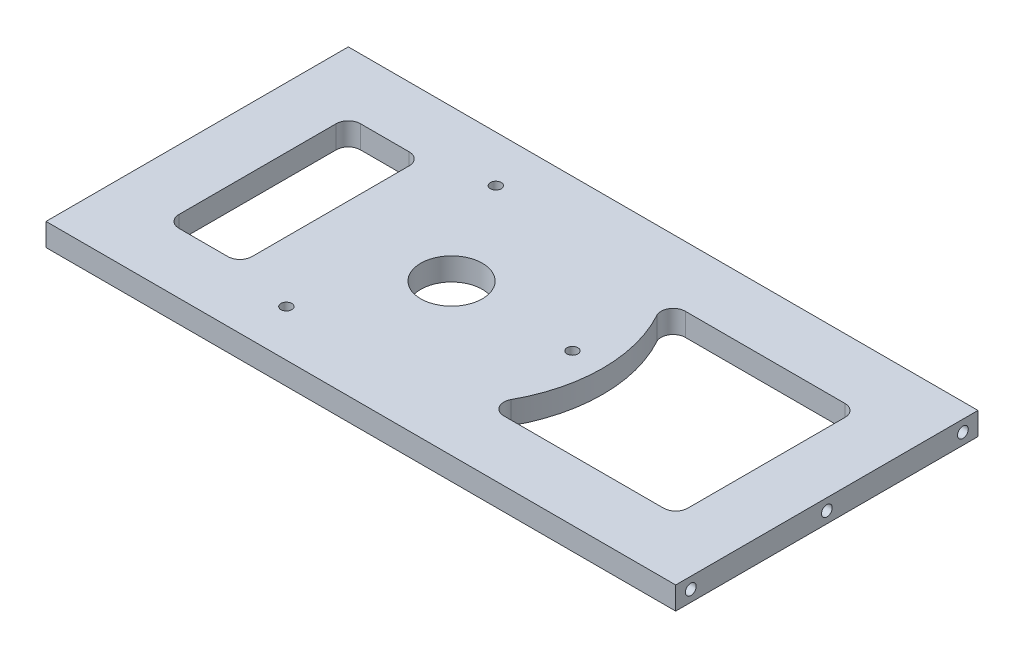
ISO-10303-21;
HEADER;
FILE_DESCRIPTION(('STEP AP214'),'2;1');
FILE_NAME('part.step','',(''),(''),'','','');
FILE_SCHEMA(('AUTOMOTIVE_DESIGN { 1 0 10303 214 1 1 1 1 }'));
ENDSEC;
DATA;
#1=APPLICATION_CONTEXT('core data for automotive mechanical design processes');
#2=APPLICATION_PROTOCOL_DEFINITION('international standard','automotive_design',2000,#1);
#3=PRODUCT_CONTEXT('',#1,'mechanical');
#4=PRODUCT('Part','Part','',(#3));
#5=PRODUCT_RELATED_PRODUCT_CATEGORY('part','',(#4));
#6=PRODUCT_DEFINITION_FORMATION('','',#4);
#7=PRODUCT_DEFINITION_CONTEXT('part definition',#1,'design');
#8=PRODUCT_DEFINITION('design','',#6,#7);
#9=PRODUCT_DEFINITION_SHAPE('','',#8);
#10=(LENGTH_UNIT() NAMED_UNIT(*) SI_UNIT(.MILLI.,.METRE.));
#11=(NAMED_UNIT(*) PLANE_ANGLE_UNIT() SI_UNIT($,.RADIAN.));
#12=(NAMED_UNIT(*) SI_UNIT($,.STERADIAN.) SOLID_ANGLE_UNIT());
#13=UNCERTAINTY_MEASURE_WITH_UNIT(LENGTH_MEASURE(1.E-05),#10,'distance_accuracy_value','');
#14=(GEOMETRIC_REPRESENTATION_CONTEXT(3) GLOBAL_UNCERTAINTY_ASSIGNED_CONTEXT((#13)) GLOBAL_UNIT_ASSIGNED_CONTEXT((#10,
#11,#12)) REPRESENTATION_CONTEXT('',''));
#15=CARTESIAN_POINT('',(0.,0.,0.));
#16=DIRECTION('',(0.,0.,1.));
#17=DIRECTION('',(1.,0.,0.));
#18=AXIS2_PLACEMENT_3D('',#15,#16,#17);
#19=CARTESIAN_POINT('',(66.13525,4.7625,31.75));
#20=DIRECTION('',(-1.,0.,0.));
#21=DIRECTION('',(0.,0.,1.));
#22=AXIS2_PLACEMENT_3D('',#19,#20,#21);
#23=PLANE('',#22);
#24=CARTESIAN_POINT('',(66.13525,2.38125000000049,28.575));
#25=DIRECTION('',(-1.,0.,0.));
#26=DIRECTION('',(0.,0.,-1.));
#27=AXIS2_PLACEMENT_3D('',#24,#25,#26);
#28=CIRCLE('',#27,1.1303);
#29=CARTESIAN_POINT('',(66.13525,2.38125000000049,27.4447));
#30=VERTEX_POINT('',#29);
#31=EDGE_CURVE('E339',#30,#30,#28,.T.);
#32=ORIENTED_EDGE('',*,*,#31,.T.);
#33=EDGE_LOOP('',(#32));
#34=FACE_BOUND('',#33,.T.);
#35=DIRECTION('',(0.,0.,-1.));
#36=VECTOR('',#35,1.);
#37=CARTESIAN_POINT('',(66.13525,0.,31.75));
#38=LINE('',#37,#36);
#39=CARTESIAN_POINT('',(66.13525,0.,31.75));
#40=VERTEX_POINT('',#39);
#41=CARTESIAN_POINT('',(66.13525,0.,-31.75));
#42=VERTEX_POINT('',#41);
#43=EDGE_CURVE('E193',#40,#42,#38,.T.);
#44=ORIENTED_EDGE('',*,*,#43,.T.);
#45=DIRECTION('',(0.,-1.,0.));
#46=VECTOR('',#45,1.);
#47=CARTESIAN_POINT('',(66.13525,4.7625,-31.75));
#48=LINE('',#47,#46);
#49=CARTESIAN_POINT('',(66.13525,4.7625,-31.75));
#50=VERTEX_POINT('',#49);
#51=EDGE_CURVE('E173',#50,#42,#48,.T.);
#52=ORIENTED_EDGE('',*,*,#51,.F.);
#53=DIRECTION('',(0.,0.,-1.));
#54=VECTOR('',#53,1.);
#55=CARTESIAN_POINT('',(66.13525,4.7625,31.75));
#56=LINE('',#55,#54);
#57=CARTESIAN_POINT('',(66.13525,4.7625,31.75));
#58=VERTEX_POINT('',#57);
#59=EDGE_CURVE('E180',#58,#50,#56,.T.);
#60=ORIENTED_EDGE('',*,*,#59,.F.);
#61=DIRECTION('',(0.,-1.,0.));
#62=VECTOR('',#61,1.);
#63=CARTESIAN_POINT('',(66.13525,4.7625,31.75));
#64=LINE('',#63,#62);
#65=EDGE_CURVE('E373',#58,#40,#64,.T.);
#66=ORIENTED_EDGE('',*,*,#65,.T.);
#67=EDGE_LOOP('',(#44,#52,#60,#66));
#68=FACE_BOUND('',#67,.T.);
#69=CARTESIAN_POINT('',(66.13525,2.38125000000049,-28.575));
#70=DIRECTION('',(-1.,0.,0.));
#71=DIRECTION('',(0.,0.,1.));
#72=AXIS2_PLACEMENT_3D('',#69,#70,#71);
#73=CIRCLE('',#72,1.1303);
#74=CARTESIAN_POINT('',(66.13525,2.38125000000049,-27.4447));
#75=VERTEX_POINT('',#74);
#76=EDGE_CURVE('E345',#75,#75,#73,.T.);
#77=ORIENTED_EDGE('',*,*,#76,.T.);
#78=EDGE_LOOP('',(#77));
#79=FACE_BOUND('',#78,.T.);
#80=CARTESIAN_POINT('',(66.13525,2.38125,0.));
#81=DIRECTION('',(-1.,0.,0.));
#82=DIRECTION('',(0.,0.,1.));
#83=AXIS2_PLACEMENT_3D('',#80,#81,#82);
#84=CIRCLE('',#83,1.1303);
#85=CARTESIAN_POINT('',(66.13525,2.38125,1.1303));
#86=VERTEX_POINT('',#85);
#87=EDGE_CURVE('E333',#86,#86,#84,.T.);
#88=ORIENTED_EDGE('',*,*,#87,.T.);
#89=EDGE_LOOP('',(#88));
#90=FACE_BOUND('',#89,.T.);
#91=ADVANCED_FACE('F31',(#34,#68,#79,#90),#23,.F.);
#92=CARTESIAN_POINT('',(-66.13525,4.7625,-31.75));
#93=DIRECTION('',(0.,0.,1.));
#94=DIRECTION('',(1.,0.,0.));
#95=AXIS2_PLACEMENT_3D('',#92,#93,#94);
#96=PLANE('',#95);
#97=DIRECTION('',(-1.,0.,0.));
#98=VECTOR('',#97,1.);
#99=CARTESIAN_POINT('',(-66.13525,0.,-31.75));
#100=LINE('',#99,#98);
#101=CARTESIAN_POINT('',(-66.13525,0.,-31.75));
#102=VERTEX_POINT('',#101);
#103=EDGE_CURVE('E375',#42,#102,#100,.T.);
#104=ORIENTED_EDGE('',*,*,#103,.T.);
#105=DIRECTION('',(0.,-1.,0.));
#106=VECTOR('',#105,1.);
#107=CARTESIAN_POINT('',(-66.13525,4.7625,-31.75));
#108=LINE('',#107,#106);
#109=CARTESIAN_POINT('',(-66.13525,4.7625,-31.75));
#110=VERTEX_POINT('',#109);
#111=EDGE_CURVE('E176',#110,#102,#108,.T.);
#112=ORIENTED_EDGE('',*,*,#111,.F.);
#113=DIRECTION('',(-1.,0.,0.));
#114=VECTOR('',#113,1.);
#115=CARTESIAN_POINT('',(-66.13525,4.7625,-31.75));
#116=LINE('',#115,#114);
#117=EDGE_CURVE('E169',#50,#110,#116,.T.);
#118=ORIENTED_EDGE('',*,*,#117,.F.);
#119=ORIENTED_EDGE('',*,*,#51,.T.);
#120=EDGE_LOOP('',(#104,#112,#118,#119));
#121=FACE_BOUND('',#120,.T.);
#122=ADVANCED_FACE('F171',(#121),#96,.F.);
#123=CARTESIAN_POINT('',(-66.13525,4.7625,31.75));
#124=DIRECTION('',(1.,0.,0.));
#125=DIRECTION('',(0.,0.,-1.));
#126=AXIS2_PLACEMENT_3D('',#123,#124,#125);
#127=PLANE('',#126);
#128=CARTESIAN_POINT('',(-66.13525,2.38125,0.));
#129=DIRECTION('',(-1.,0.,0.));
#130=DIRECTION('',(0.,0.,1.));
#131=AXIS2_PLACEMENT_3D('',#128,#129,#130);
#132=CIRCLE('',#131,1.1303);
#133=CARTESIAN_POINT('',(-66.13525,2.38125,1.1303));
#134=VERTEX_POINT('',#133);
#135=EDGE_CURVE('E351',#134,#134,#132,.T.);
#136=ORIENTED_EDGE('',*,*,#135,.F.);
#137=EDGE_LOOP('',(#136));
#138=FACE_BOUND('',#137,.T.);
#139=CARTESIAN_POINT('',(-66.13525,2.38125000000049,28.575));
#140=DIRECTION('',(-1.,0.,0.));
#141=DIRECTION('',(0.,0.,-1.));
#142=AXIS2_PLACEMENT_3D('',#139,#140,#141);
#143=CIRCLE('',#142,1.1303);
#144=CARTESIAN_POINT('',(-66.13525,2.38125000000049,27.4447));
#145=VERTEX_POINT('',#144);
#146=EDGE_CURVE('E357',#145,#145,#143,.T.);
#147=ORIENTED_EDGE('',*,*,#146,.F.);
#148=EDGE_LOOP('',(#147));
#149=FACE_BOUND('',#148,.T.);
#150=CARTESIAN_POINT('',(-66.13525,2.38125000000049,-28.575));
#151=DIRECTION('',(-1.,0.,0.));
#152=DIRECTION('',(0.,0.,1.));
#153=AXIS2_PLACEMENT_3D('',#150,#151,#152);
#154=CIRCLE('',#153,1.1303);
#155=CARTESIAN_POINT('',(-66.13525,2.38125000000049,-27.4447));
#156=VERTEX_POINT('',#155);
#157=EDGE_CURVE('E363',#156,#156,#154,.T.);
#158=ORIENTED_EDGE('',*,*,#157,.F.);
#159=EDGE_LOOP('',(#158));
#160=FACE_BOUND('',#159,.T.);
#161=DIRECTION('',(0.,0.,1.));
#162=VECTOR('',#161,1.);
#163=CARTESIAN_POINT('',(-66.13525,0.,31.75));
#164=LINE('',#163,#162);
#165=CARTESIAN_POINT('',(-66.13525,0.,31.75));
#166=VERTEX_POINT('',#165);
#167=EDGE_CURVE('E377',#102,#166,#164,.T.);
#168=ORIENTED_EDGE('',*,*,#167,.T.);
#169=DIRECTION('',(0.,-1.,0.));
#170=VECTOR('',#169,1.);
#171=CARTESIAN_POINT('',(-66.13525,4.7625,31.75));
#172=LINE('',#171,#170);
#173=CARTESIAN_POINT('',(-66.13525,4.7625,31.75));
#174=VERTEX_POINT('',#173);
#175=EDGE_CURVE('E198',#174,#166,#172,.T.);
#176=ORIENTED_EDGE('',*,*,#175,.F.);
#177=DIRECTION('',(0.,0.,1.));
#178=VECTOR('',#177,1.);
#179=CARTESIAN_POINT('',(-66.13525,4.7625,31.75));
#180=LINE('',#179,#178);
#181=EDGE_CURVE('E179',#110,#174,#180,.T.);
#182=ORIENTED_EDGE('',*,*,#181,.F.);
#183=ORIENTED_EDGE('',*,*,#111,.T.);
#184=EDGE_LOOP('',(#168,#176,#182,#183));
#185=FACE_BOUND('',#184,.T.);
#186=ADVANCED_FACE('F388',(#138,#149,#160,#185),#127,.F.);
#187=CARTESIAN_POINT('',(-66.13525,4.7625,31.75));
#188=DIRECTION('',(0.,0.,-1.));
#189=DIRECTION('',(-1.,0.,0.));
#190=AXIS2_PLACEMENT_3D('',#187,#188,#189);
#191=PLANE('',#190);
#192=DIRECTION('',(1.,0.,0.));
#193=VECTOR('',#192,1.);
#194=CARTESIAN_POINT('',(-66.13525,0.,31.75));
#195=LINE('',#194,#193);
#196=EDGE_CURVE('E189',#166,#40,#195,.T.);
#197=ORIENTED_EDGE('',*,*,#196,.T.);
#198=ORIENTED_EDGE('',*,*,#65,.F.);
#199=DIRECTION('',(1.,0.,0.));
#200=VECTOR('',#199,1.);
#201=CARTESIAN_POINT('',(-66.13525,4.7625,31.75));
#202=LINE('',#201,#200);
#203=EDGE_CURVE('E185',#174,#58,#202,.T.);
#204=ORIENTED_EDGE('',*,*,#203,.F.);
#205=ORIENTED_EDGE('',*,*,#175,.T.);
#206=EDGE_LOOP('',(#197,#198,#204,#205));
#207=FACE_BOUND('',#206,.T.);
#208=ADVANCED_FACE('F384',(#207),#191,.F.);
#209=CARTESIAN_POINT('',(66.13525,4.7625,-31.75));
#210=DIRECTION('',(0.,-1.,0.));
#211=DIRECTION('',(0.,0.,-1.));
#212=AXIS2_PLACEMENT_3D('',#209,#210,#211);
#213=PLANE('',#212);
#214=DIRECTION('',(-1.,0.,0.));
#215=VECTOR('',#214,1.);
#216=CARTESIAN_POINT('',(53.43525,4.7625,-19.05));
#217=LINE('',#216,#215);
#218=CARTESIAN_POINT('',(50.89525,4.7625,-19.05));
#219=VERTEX_POINT('',#218);
#220=CARTESIAN_POINT('',(17.3536852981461,4.7625,-19.05));
#221=VERTEX_POINT('',#220);
#222=EDGE_CURVE('E458',#219,#221,#217,.T.);
#223=ORIENTED_EDGE('',*,*,#222,.F.);
#224=CARTESIAN_POINT('',(50.89525,4.7625,-16.51));
#225=DIRECTION('',(0.,-1.,0.));
#226=DIRECTION('',(0.,0.,-1.));
#227=AXIS2_PLACEMENT_3D('',#224,#225,#226);
#228=CIRCLE('',#227,2.54);
#229=CARTESIAN_POINT('',(53.43525,4.7625,-16.51));
#230=VERTEX_POINT('',#229);
#231=EDGE_CURVE('E258',#219,#230,#228,.T.);
#232=ORIENTED_EDGE('',*,*,#231,.T.);
#233=DIRECTION('',(0.,0.,-1.));
#234=VECTOR('',#233,1.);
#235=CARTESIAN_POINT('',(53.43525,4.7625,19.05));
#236=LINE('',#235,#234);
#237=CARTESIAN_POINT('',(53.43525,4.7625,16.51));
#238=VERTEX_POINT('',#237);
#239=EDGE_CURVE('E455',#238,#230,#236,.T.);
#240=ORIENTED_EDGE('',*,*,#239,.F.);
#241=CARTESIAN_POINT('',(50.89525,4.7625,16.51));
#242=DIRECTION('',(0.,-1.,0.));
#243=DIRECTION('',(0.,0.,-1.));
#244=AXIS2_PLACEMENT_3D('',#241,#242,#243);
#245=CIRCLE('',#244,2.54);
#246=CARTESIAN_POINT('',(50.89525,4.7625,19.05));
#247=VERTEX_POINT('',#246);
#248=EDGE_CURVE('E242',#238,#247,#245,.T.);
#249=ORIENTED_EDGE('',*,*,#248,.T.);
#250=DIRECTION('',(1.,0.,0.));
#251=VECTOR('',#250,1.);
#252=CARTESIAN_POINT('',(12.7,4.7625,19.05));
#253=LINE('',#252,#251);
#254=CARTESIAN_POINT('',(17.3536852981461,4.7625,19.05));
#255=VERTEX_POINT('',#254);
#256=EDGE_CURVE('E461',#255,#247,#253,.T.);
#257=ORIENTED_EDGE('',*,*,#256,.F.);
#258=CARTESIAN_POINT('',(17.3536852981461,4.7625,16.51));
#259=DIRECTION('',(0.,-1.,0.));
#260=DIRECTION('',(0.,0.,-1.));
#261=AXIS2_PLACEMENT_3D('',#258,#259,#260);
#262=CIRCLE('',#261,2.54);
#263=CARTESIAN_POINT('',(15.1274863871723,4.7625,15.287037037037));
#264=VERTEX_POINT('',#263);
#265=EDGE_CURVE('E250',#255,#264,#262,.T.);
#266=ORIENTED_EDGE('',*,*,#265,.T.);
#267=CARTESIAN_POINT('',(-12.7,4.7625,0.));
#268=DIRECTION('',(0.,-1.,0.));
#269=DIRECTION('',(0.,0.,1.));
#270=AXIS2_PLACEMENT_3D('',#267,#268,#269);
#271=CIRCLE('',#270,31.75);
#272=CARTESIAN_POINT('',(15.1274863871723,4.7625,-15.287037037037));
#273=VERTEX_POINT('',#272);
#274=EDGE_CURVE('E460',#273,#264,#271,.T.);
#275=ORIENTED_EDGE('',*,*,#274,.F.);
#276=CARTESIAN_POINT('',(17.3536852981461,4.7625,-16.51));
#277=DIRECTION('',(0.,-1.,0.));
#278=DIRECTION('',(0.,0.,-1.));
#279=AXIS2_PLACEMENT_3D('',#276,#277,#278);
#280=CIRCLE('',#279,2.54);
#281=EDGE_CURVE('E261',#273,#221,#280,.T.);
#282=ORIENTED_EDGE('',*,*,#281,.T.);
#283=EDGE_LOOP('',(#223,#232,#240,#249,#257,#266,#275,#282));
#284=FACE_BOUND('',#283,.T.);
#285=DIRECTION('',(0.,0.,1.));
#286=VECTOR('',#285,1.);
#287=CARTESIAN_POINT('',(-53.43525,4.7625,-19.05));
#288=LINE('',#287,#286);
#289=CARTESIAN_POINT('',(-53.43525,4.7625,-16.51));
#290=VERTEX_POINT('',#289);
#291=CARTESIAN_POINT('',(-53.43525,4.7625,16.51));
#292=VERTEX_POINT('',#291);
#293=EDGE_CURVE('E271',#290,#292,#288,.T.);
#294=ORIENTED_EDGE('',*,*,#293,.F.);
#295=CARTESIAN_POINT('',(-50.89525,4.7625,-16.51));
#296=DIRECTION('',(0.,-1.,0.));
#297=DIRECTION('',(0.,0.,-1.));
#298=AXIS2_PLACEMENT_3D('',#295,#296,#297);
#299=CIRCLE('',#298,2.54);
#300=CARTESIAN_POINT('',(-50.89525,4.7625,-19.05));
#301=VERTEX_POINT('',#300);
#302=EDGE_CURVE('E39',#290,#301,#299,.T.);
#303=ORIENTED_EDGE('',*,*,#302,.T.);
#304=DIRECTION('',(-1.,0.,0.));
#305=VECTOR('',#304,1.);
#306=CARTESIAN_POINT('',(-38.1,4.7625,-19.05));
#307=LINE('',#306,#305);
#308=CARTESIAN_POINT('',(-40.64,4.7625,-19.05));
#309=VERTEX_POINT('',#308);
#310=EDGE_CURVE('E269',#309,#301,#307,.T.);
#311=ORIENTED_EDGE('',*,*,#310,.F.);
#312=CARTESIAN_POINT('',(-40.64,4.7625,-16.51));
#313=DIRECTION('',(0.,-1.,0.));
#314=DIRECTION('',(0.,0.,-1.));
#315=AXIS2_PLACEMENT_3D('',#312,#313,#314);
#316=CIRCLE('',#315,2.54);
#317=CARTESIAN_POINT('',(-38.1,4.7625,-16.51));
#318=VERTEX_POINT('',#317);
#319=EDGE_CURVE('E254',#309,#318,#316,.T.);
#320=ORIENTED_EDGE('',*,*,#319,.T.);
#321=DIRECTION('',(0.,0.,-1.));
#322=VECTOR('',#321,1.);
#323=CARTESIAN_POINT('',(-38.1,4.7625,-19.05));
#324=LINE('',#323,#322);
#325=CARTESIAN_POINT('',(-38.1,4.7625,16.51));
#326=VERTEX_POINT('',#325);
#327=EDGE_CURVE('E300',#326,#318,#324,.T.);
#328=ORIENTED_EDGE('',*,*,#327,.F.);
#329=CARTESIAN_POINT('',(-40.64,4.7625,16.51));
#330=DIRECTION('',(0.,-1.,0.));
#331=DIRECTION('',(0.,0.,-1.));
#332=AXIS2_PLACEMENT_3D('',#329,#330,#331);
#333=CIRCLE('',#332,2.54);
#334=CARTESIAN_POINT('',(-40.64,4.7625,19.05));
#335=VERTEX_POINT('',#334);
#336=EDGE_CURVE('E238',#326,#335,#333,.T.);
#337=ORIENTED_EDGE('',*,*,#336,.T.);
#338=DIRECTION('',(1.,0.,0.));
#339=VECTOR('',#338,1.);
#340=CARTESIAN_POINT('',(-53.43525,4.7625,19.05));
#341=LINE('',#340,#339);
#342=CARTESIAN_POINT('',(-50.89525,4.7625,19.05));
#343=VERTEX_POINT('',#342);
#344=EDGE_CURVE('E307',#343,#335,#341,.T.);
#345=ORIENTED_EDGE('',*,*,#344,.F.);
#346=CARTESIAN_POINT('',(-50.89525,4.7625,16.51));
#347=DIRECTION('',(0.,-1.,0.));
#348=DIRECTION('',(0.,0.,-1.));
#349=AXIS2_PLACEMENT_3D('',#346,#347,#348);
#350=CIRCLE('',#349,2.54);
#351=EDGE_CURVE('E246',#343,#292,#350,.T.);
#352=ORIENTED_EDGE('',*,*,#351,.T.);
#353=EDGE_LOOP('',(#294,#303,#311,#320,#328,#337,#345,#352));
#354=FACE_BOUND('',#353,.T.);
#355=CARTESIAN_POINT('',(-25.4,4.7625,21.9970452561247));
#356=DIRECTION('',(0.,1.,0.));
#357=DIRECTION('',(0.,0.,1.));
#358=AXIS2_PLACEMENT_3D('',#355,#356,#357);
#359=CIRCLE('',#358,1.143);
#360=CARTESIAN_POINT('',(-25.4,4.7625,23.1400452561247));
#361=VERTEX_POINT('',#360);
#362=EDGE_CURVE('E304',#361,#361,#359,.T.);
#363=ORIENTED_EDGE('',*,*,#362,.F.);
#364=EDGE_LOOP('',(#363));
#365=FACE_BOUND('',#364,.T.);
#366=CARTESIAN_POINT('',(12.7,4.7625,0.));
#367=DIRECTION('',(0.,1.,0.));
#368=DIRECTION('',(0.,0.,1.));
#369=AXIS2_PLACEMENT_3D('',#366,#367,#368);
#370=CIRCLE('',#369,1.143);
#371=CARTESIAN_POINT('',(12.7,4.7625,1.14299999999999));
#372=VERTEX_POINT('',#371);
#373=EDGE_CURVE('E315',#372,#372,#370,.T.);
#374=ORIENTED_EDGE('',*,*,#373,.F.);
#375=EDGE_LOOP('',(#374));
#376=FACE_BOUND('',#375,.T.);
#377=CARTESIAN_POINT('',(-25.4,4.7625,-21.9970452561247));
#378=DIRECTION('',(0.,1.,0.));
#379=DIRECTION('',(0.,0.,1.));
#380=AXIS2_PLACEMENT_3D('',#377,#378,#379);
#381=CIRCLE('',#380,1.143);
#382=CARTESIAN_POINT('',(-25.4,4.7625,-20.8540452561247));
#383=VERTEX_POINT('',#382);
#384=EDGE_CURVE('E321',#383,#383,#381,.T.);
#385=ORIENTED_EDGE('',*,*,#384,.F.);
#386=EDGE_LOOP('',(#385));
#387=FACE_BOUND('',#386,.T.);
#388=CARTESIAN_POINT('',(-12.7,4.7625,0.));
#389=DIRECTION('',(0.,1.,0.));
#390=DIRECTION('',(0.,0.,1.));
#391=AXIS2_PLACEMENT_3D('',#388,#389,#390);
#392=CIRCLE('',#391,6.477);
#393=CARTESIAN_POINT('',(-12.7,4.7625,6.477));
#394=VERTEX_POINT('',#393);
#395=EDGE_CURVE('E327',#394,#394,#392,.T.);
#396=ORIENTED_EDGE('',*,*,#395,.F.);
#397=EDGE_LOOP('',(#396));
#398=FACE_BOUND('',#397,.T.);
#399=ORIENTED_EDGE('',*,*,#59,.T.);
#400=ORIENTED_EDGE('',*,*,#117,.T.);
#401=ORIENTED_EDGE('',*,*,#181,.T.);
#402=ORIENTED_EDGE('',*,*,#203,.T.);
#403=EDGE_LOOP('',(#399,#400,#401,#402));
#404=FACE_BOUND('',#403,.T.);
#405=ADVANCED_FACE('F183',(#284,#354,#365,#376,#387,#398,#404),#213,.F.);
#406=CARTESIAN_POINT('',(66.13525,0.,-31.75));
#407=DIRECTION('',(0.,-1.,0.));
#408=DIRECTION('',(0.,0.,-1.));
#409=AXIS2_PLACEMENT_3D('',#406,#407,#408);
#410=PLANE('',#409);
#411=DIRECTION('',(1.,0.,0.));
#412=VECTOR('',#411,1.);
#413=CARTESIAN_POINT('',(12.7,0.,19.05));
#414=LINE('',#413,#412);
#415=CARTESIAN_POINT('',(17.3536852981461,0.,19.05));
#416=VERTEX_POINT('',#415);
#417=CARTESIAN_POINT('',(50.89525,0.,19.05));
#418=VERTEX_POINT('',#417);
#419=EDGE_CURVE('E280',#416,#418,#414,.T.);
#420=ORIENTED_EDGE('',*,*,#419,.T.);
#421=CARTESIAN_POINT('',(50.89525,0.,16.51));
#422=DIRECTION('',(0.,-1.,0.));
#423=DIRECTION('',(0.,0.,-1.));
#424=AXIS2_PLACEMENT_3D('',#421,#422,#423);
#425=CIRCLE('',#424,2.54);
#426=CARTESIAN_POINT('',(53.43525,0.,16.51));
#427=VERTEX_POINT('',#426);
#428=EDGE_CURVE('E244',#418,#427,#425,.F.);
#429=ORIENTED_EDGE('',*,*,#428,.T.);
#430=DIRECTION('',(0.,0.,-1.));
#431=VECTOR('',#430,1.);
#432=CARTESIAN_POINT('',(53.43525,0.,19.05));
#433=LINE('',#432,#431);
#434=CARTESIAN_POINT('',(53.43525,0.,-16.51));
#435=VERTEX_POINT('',#434);
#436=EDGE_CURVE('E451',#427,#435,#433,.T.);
#437=ORIENTED_EDGE('',*,*,#436,.T.);
#438=CARTESIAN_POINT('',(50.89525,0.,-16.51));
#439=DIRECTION('',(0.,-1.,0.));
#440=DIRECTION('',(0.,0.,-1.));
#441=AXIS2_PLACEMENT_3D('',#438,#439,#440);
#442=CIRCLE('',#441,2.54);
#443=CARTESIAN_POINT('',(50.89525,0.,-19.05));
#444=VERTEX_POINT('',#443);
#445=EDGE_CURVE('E53',#435,#444,#442,.F.);
#446=ORIENTED_EDGE('',*,*,#445,.T.);
#447=DIRECTION('',(-1.,0.,0.));
#448=VECTOR('',#447,1.);
#449=CARTESIAN_POINT('',(53.43525,0.,-19.05));
#450=LINE('',#449,#448);
#451=CARTESIAN_POINT('',(17.3536852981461,0.,-19.05));
#452=VERTEX_POINT('',#451);
#453=EDGE_CURVE('E443',#444,#452,#450,.T.);
#454=ORIENTED_EDGE('',*,*,#453,.T.);
#455=CARTESIAN_POINT('',(17.3536852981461,0.,-16.51));
#456=DIRECTION('',(0.,-1.,0.));
#457=DIRECTION('',(0.,0.,-1.));
#458=AXIS2_PLACEMENT_3D('',#455,#456,#457);
#459=CIRCLE('',#458,2.54);
#460=CARTESIAN_POINT('',(15.1274863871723,0.,-15.287037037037));
#461=VERTEX_POINT('',#460);
#462=EDGE_CURVE('E263',#452,#461,#459,.F.);
#463=ORIENTED_EDGE('',*,*,#462,.T.);
#464=CARTESIAN_POINT('',(-12.7,0.,0.));
#465=DIRECTION('',(0.,-1.,0.));
#466=DIRECTION('',(0.,0.,1.));
#467=AXIS2_PLACEMENT_3D('',#464,#465,#466);
#468=CIRCLE('',#467,31.75);
#469=CARTESIAN_POINT('',(15.1274863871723,0.,15.287037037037));
#470=VERTEX_POINT('',#469);
#471=EDGE_CURVE('E441',#461,#470,#468,.T.);
#472=ORIENTED_EDGE('',*,*,#471,.T.);
#473=CARTESIAN_POINT('',(17.3536852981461,0.,16.51));
#474=DIRECTION('',(0.,-1.,0.));
#475=DIRECTION('',(0.,0.,-1.));
#476=AXIS2_PLACEMENT_3D('',#473,#474,#475);
#477=CIRCLE('',#476,2.54);
#478=EDGE_CURVE('E252',#470,#416,#477,.F.);
#479=ORIENTED_EDGE('',*,*,#478,.T.);
#480=EDGE_LOOP('',(#420,#429,#437,#446,#454,#463,#472,#479));
#481=FACE_BOUND('',#480,.T.);
#482=DIRECTION('',(0.,0.,-1.));
#483=VECTOR('',#482,1.);
#484=CARTESIAN_POINT('',(-38.1,0.,-19.05));
#485=LINE('',#484,#483);
#486=CARTESIAN_POINT('',(-38.1,0.,16.51));
#487=VERTEX_POINT('',#486);
#488=CARTESIAN_POINT('',(-38.1,0.,-16.51));
#489=VERTEX_POINT('',#488);
#490=EDGE_CURVE('E298',#487,#489,#485,.T.);
#491=ORIENTED_EDGE('',*,*,#490,.T.);
#492=CARTESIAN_POINT('',(-40.64,0.,-16.51));
#493=DIRECTION('',(0.,-1.,0.));
#494=DIRECTION('',(0.,0.,-1.));
#495=AXIS2_PLACEMENT_3D('',#492,#493,#494);
#496=CIRCLE('',#495,2.54);
#497=CARTESIAN_POINT('',(-40.64,0.,-19.05));
#498=VERTEX_POINT('',#497);
#499=EDGE_CURVE('E256',#489,#498,#496,.F.);
#500=ORIENTED_EDGE('',*,*,#499,.T.);
#501=DIRECTION('',(-1.,0.,0.));
#502=VECTOR('',#501,1.);
#503=CARTESIAN_POINT('',(-38.1,0.,-19.05));
#504=LINE('',#503,#502);
#505=CARTESIAN_POINT('',(-50.89525,0.,-19.05));
#506=VERTEX_POINT('',#505);
#507=EDGE_CURVE('E291',#498,#506,#504,.T.);
#508=ORIENTED_EDGE('',*,*,#507,.T.);
#509=CARTESIAN_POINT('',(-50.89525,0.,-16.51));
#510=DIRECTION('',(0.,-1.,0.));
#511=DIRECTION('',(0.,0.,-1.));
#512=AXIS2_PLACEMENT_3D('',#509,#510,#511);
#513=CIRCLE('',#512,2.54);
#514=CARTESIAN_POINT('',(-53.43525,0.,-16.51));
#515=VERTEX_POINT('',#514);
#516=EDGE_CURVE('E11',#506,#515,#513,.F.);
#517=ORIENTED_EDGE('',*,*,#516,.T.);
#518=DIRECTION('',(0.,0.,1.));
#519=VECTOR('',#518,1.);
#520=CARTESIAN_POINT('',(-53.43525,0.,-19.05));
#521=LINE('',#520,#519);
#522=CARTESIAN_POINT('',(-53.43525,0.,16.51));
#523=VERTEX_POINT('',#522);
#524=EDGE_CURVE('E289',#515,#523,#521,.T.);
#525=ORIENTED_EDGE('',*,*,#524,.T.);
#526=CARTESIAN_POINT('',(-50.89525,0.,16.51));
#527=DIRECTION('',(0.,-1.,0.));
#528=DIRECTION('',(0.,0.,-1.));
#529=AXIS2_PLACEMENT_3D('',#526,#527,#528);
#530=CIRCLE('',#529,2.54);
#531=CARTESIAN_POINT('',(-50.89525,0.,19.05));
#532=VERTEX_POINT('',#531);
#533=EDGE_CURVE('E248',#523,#532,#530,.F.);
#534=ORIENTED_EDGE('',*,*,#533,.T.);
#535=DIRECTION('',(1.,0.,0.));
#536=VECTOR('',#535,1.);
#537=CARTESIAN_POINT('',(-53.43525,0.,19.05));
#538=LINE('',#537,#536);
#539=CARTESIAN_POINT('',(-40.64,0.,19.05));
#540=VERTEX_POINT('',#539);
#541=EDGE_CURVE('E295',#532,#540,#538,.T.);
#542=ORIENTED_EDGE('',*,*,#541,.T.);
#543=CARTESIAN_POINT('',(-40.64,0.,16.51));
#544=DIRECTION('',(0.,-1.,0.));
#545=DIRECTION('',(0.,0.,-1.));
#546=AXIS2_PLACEMENT_3D('',#543,#544,#545);
#547=CIRCLE('',#546,2.54);
#548=EDGE_CURVE('E240',#540,#487,#547,.F.);
#549=ORIENTED_EDGE('',*,*,#548,.T.);
#550=EDGE_LOOP('',(#491,#500,#508,#517,#525,#534,#542,#549));
#551=FACE_BOUND('',#550,.T.);
#552=CARTESIAN_POINT('',(-25.4,0.,21.9970452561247));
#553=DIRECTION('',(0.,1.,0.));
#554=DIRECTION('',(0.,0.,1.));
#555=AXIS2_PLACEMENT_3D('',#552,#553,#554);
#556=CIRCLE('',#555,1.143);
#557=CARTESIAN_POINT('',(-25.4,0.,23.1400452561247));
#558=VERTEX_POINT('',#557);
#559=EDGE_CURVE('E312',#558,#558,#556,.T.);
#560=ORIENTED_EDGE('',*,*,#559,.T.);
#561=EDGE_LOOP('',(#560));
#562=FACE_BOUND('',#561,.T.);
#563=CARTESIAN_POINT('',(12.7,0.,0.));
#564=DIRECTION('',(0.,1.,0.));
#565=DIRECTION('',(0.,0.,1.));
#566=AXIS2_PLACEMENT_3D('',#563,#564,#565);
#567=CIRCLE('',#566,1.143);
#568=CARTESIAN_POINT('',(12.7,0.,1.14299999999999));
#569=VERTEX_POINT('',#568);
#570=EDGE_CURVE('E318',#569,#569,#567,.T.);
#571=ORIENTED_EDGE('',*,*,#570,.T.);
#572=EDGE_LOOP('',(#571));
#573=FACE_BOUND('',#572,.T.);
#574=CARTESIAN_POINT('',(-25.4,0.,-21.9970452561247));
#575=DIRECTION('',(0.,1.,0.));
#576=DIRECTION('',(0.,0.,1.));
#577=AXIS2_PLACEMENT_3D('',#574,#575,#576);
#578=CIRCLE('',#577,1.143);
#579=CARTESIAN_POINT('',(-25.4,0.,-20.8540452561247));
#580=VERTEX_POINT('',#579);
#581=EDGE_CURVE('E324',#580,#580,#578,.T.);
#582=ORIENTED_EDGE('',*,*,#581,.T.);
#583=EDGE_LOOP('',(#582));
#584=FACE_BOUND('',#583,.T.);
#585=CARTESIAN_POINT('',(-12.7,0.,0.));
#586=DIRECTION('',(0.,1.,0.));
#587=DIRECTION('',(0.,0.,1.));
#588=AXIS2_PLACEMENT_3D('',#585,#586,#587);
#589=CIRCLE('',#588,6.477);
#590=CARTESIAN_POINT('',(-12.7,0.,6.477));
#591=VERTEX_POINT('',#590);
#592=EDGE_CURVE('E330',#591,#591,#589,.T.);
#593=ORIENTED_EDGE('',*,*,#592,.T.);
#594=EDGE_LOOP('',(#593));
#595=FACE_BOUND('',#594,.T.);
#596=ORIENTED_EDGE('',*,*,#43,.F.);
#597=ORIENTED_EDGE('',*,*,#196,.F.);
#598=ORIENTED_EDGE('',*,*,#167,.F.);
#599=ORIENTED_EDGE('',*,*,#103,.F.);
#600=EDGE_LOOP('',(#596,#597,#598,#599));
#601=FACE_BOUND('',#600,.T.);
#602=ADVANCED_FACE('F287',(#481,#551,#562,#573,#584,#595,#601),#410,.T.);
#603=CARTESIAN_POINT('',(-55.97525,2.38125000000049,-28.575));
#604=DIRECTION('',(-1.,0.,0.));
#605=DIRECTION('',(0.,0.,1.));
#606=AXIS2_PLACEMENT_3D('',#603,#604,#605);
#607=CYLINDRICAL_SURFACE('',#606,1.1303);
#608=CARTESIAN_POINT('',(-55.97525,2.38125000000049,-28.575));
#609=DIRECTION('',(-1.,0.,0.));
#610=DIRECTION('',(0.,0.,1.));
#611=AXIS2_PLACEMENT_3D('',#608,#609,#610);
#612=CIRCLE('',#611,1.1303);
#613=CARTESIAN_POINT('',(-55.97525,2.38125000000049,-27.4447));
#614=VERTEX_POINT('',#613);
#615=EDGE_CURVE('E366',#614,#614,#612,.T.);
#616=ORIENTED_EDGE('',*,*,#615,.F.);
#617=EDGE_LOOP('',(#616));
#618=FACE_BOUND('',#617,.T.);
#619=ORIENTED_EDGE('',*,*,#157,.T.);
#620=EDGE_LOOP('',(#619));
#621=FACE_BOUND('',#620,.T.);
#622=ADVANCED_FACE('F559',(#618,#621),#607,.F.);
#623=CARTESIAN_POINT('',(-55.97525,2.38125000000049,-28.575));
#624=DIRECTION('',(-1.,0.,0.));
#625=DIRECTION('',(0.,0.,1.));
#626=AXIS2_PLACEMENT_3D('',#623,#624,#625);
#627=PLANE('',#626);
#628=ORIENTED_EDGE('',*,*,#615,.T.);
#629=EDGE_LOOP('',(#628));
#630=FACE_BOUND('',#629,.T.);
#631=ADVANCED_FACE('F555',(#630),#627,.T.);
#632=CARTESIAN_POINT('',(-55.97525,2.38125000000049,28.575));
#633=DIRECTION('',(-1.,0.,0.));
#634=DIRECTION('',(0.,0.,1.));
#635=AXIS2_PLACEMENT_3D('',#632,#633,#634);
#636=CYLINDRICAL_SURFACE('',#635,1.1303);
#637=CARTESIAN_POINT('',(-55.97525,2.38125000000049,28.575));
#638=DIRECTION('',(-1.,0.,0.));
#639=DIRECTION('',(0.,0.,-1.));
#640=AXIS2_PLACEMENT_3D('',#637,#638,#639);
#641=CIRCLE('',#640,1.1303);
#642=CARTESIAN_POINT('',(-55.97525,2.38125000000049,27.4447));
#643=VERTEX_POINT('',#642);
#644=EDGE_CURVE('E360',#643,#643,#641,.T.);
#645=ORIENTED_EDGE('',*,*,#644,.F.);
#646=EDGE_LOOP('',(#645));
#647=FACE_BOUND('',#646,.T.);
#648=ORIENTED_EDGE('',*,*,#146,.T.);
#649=EDGE_LOOP('',(#648));
#650=FACE_BOUND('',#649,.T.);
#651=ADVANCED_FACE('F551',(#647,#650),#636,.F.);
#652=CARTESIAN_POINT('',(-55.97525,2.38125000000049,28.575));
#653=DIRECTION('',(1.,0.,0.));
#654=DIRECTION('',(0.,0.,-1.));
#655=AXIS2_PLACEMENT_3D('',#652,#653,#654);
#656=PLANE('',#655);
#657=ORIENTED_EDGE('',*,*,#644,.T.);
#658=EDGE_LOOP('',(#657));
#659=FACE_BOUND('',#658,.T.);
#660=ADVANCED_FACE('F547',(#659),#656,.F.);
#661=CARTESIAN_POINT('',(-55.97525,2.38125,0.));
#662=DIRECTION('',(-1.,0.,0.));
#663=DIRECTION('',(0.,0.,1.));
#664=AXIS2_PLACEMENT_3D('',#661,#662,#663);
#665=CYLINDRICAL_SURFACE('',#664,1.1303);
#666=CARTESIAN_POINT('',(-55.97525,2.38125,0.));
#667=DIRECTION('',(-1.,0.,0.));
#668=DIRECTION('',(0.,0.,1.));
#669=AXIS2_PLACEMENT_3D('',#666,#667,#668);
#670=CIRCLE('',#669,1.1303);
#671=CARTESIAN_POINT('',(-55.97525,2.38125,1.1303));
#672=VERTEX_POINT('',#671);
#673=EDGE_CURVE('E354',#672,#672,#670,.T.);
#674=ORIENTED_EDGE('',*,*,#673,.F.);
#675=EDGE_LOOP('',(#674));
#676=FACE_BOUND('',#675,.T.);
#677=ORIENTED_EDGE('',*,*,#135,.T.);
#678=EDGE_LOOP('',(#677));
#679=FACE_BOUND('',#678,.T.);
#680=ADVANCED_FACE('F543',(#676,#679),#665,.F.);
#681=CARTESIAN_POINT('',(-55.97525,2.38125,0.));
#682=DIRECTION('',(-1.,0.,0.));
#683=DIRECTION('',(0.,0.,1.));
#684=AXIS2_PLACEMENT_3D('',#681,#682,#683);
#685=PLANE('',#684);
#686=ORIENTED_EDGE('',*,*,#673,.T.);
#687=EDGE_LOOP('',(#686));
#688=FACE_BOUND('',#687,.T.);
#689=ADVANCED_FACE('F539',(#688),#685,.T.);
#690=CARTESIAN_POINT('',(55.97525,2.38125000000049,-28.575));
#691=DIRECTION('',(1.,0.,0.));
#692=DIRECTION('',(0.,0.,-1.));
#693=AXIS2_PLACEMENT_3D('',#690,#691,#692);
#694=CYLINDRICAL_SURFACE('',#693,1.1303);
#695=CARTESIAN_POINT('',(55.97525,2.38125000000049,-28.575));
#696=DIRECTION('',(-1.,0.,0.));
#697=DIRECTION('',(0.,0.,1.));
#698=AXIS2_PLACEMENT_3D('',#695,#696,#697);
#699=CIRCLE('',#698,1.1303);
#700=CARTESIAN_POINT('',(55.97525,2.38125000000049,-27.4447));
#701=VERTEX_POINT('',#700);
#702=EDGE_CURVE('E348',#701,#701,#699,.T.);
#703=ORIENTED_EDGE('',*,*,#702,.T.);
#704=EDGE_LOOP('',(#703));
#705=FACE_BOUND('',#704,.T.);
#706=ORIENTED_EDGE('',*,*,#76,.F.);
#707=EDGE_LOOP('',(#706));
#708=FACE_BOUND('',#707,.T.);
#709=ADVANCED_FACE('F535',(#705,#708),#694,.F.);
#710=CARTESIAN_POINT('',(55.97525,2.38125000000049,-28.575));
#711=DIRECTION('',(1.,0.,0.));
#712=DIRECTION('',(0.,0.,1.));
#713=AXIS2_PLACEMENT_3D('',#710,#711,#712);
#714=PLANE('',#713);
#715=ORIENTED_EDGE('',*,*,#702,.F.);
#716=EDGE_LOOP('',(#715));
#717=FACE_BOUND('',#716,.T.);
#718=ADVANCED_FACE('F531',(#717),#714,.T.);
#719=CARTESIAN_POINT('',(55.97525,2.38125000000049,28.575));
#720=DIRECTION('',(1.,0.,0.));
#721=DIRECTION('',(0.,0.,-1.));
#722=AXIS2_PLACEMENT_3D('',#719,#720,#721);
#723=CYLINDRICAL_SURFACE('',#722,1.1303);
#724=CARTESIAN_POINT('',(55.97525,2.38125000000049,28.575));
#725=DIRECTION('',(-1.,0.,0.));
#726=DIRECTION('',(0.,0.,-1.));
#727=AXIS2_PLACEMENT_3D('',#724,#725,#726);
#728=CIRCLE('',#727,1.1303);
#729=CARTESIAN_POINT('',(55.97525,2.38125000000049,27.4447));
#730=VERTEX_POINT('',#729);
#731=EDGE_CURVE('E342',#730,#730,#728,.T.);
#732=ORIENTED_EDGE('',*,*,#731,.T.);
#733=EDGE_LOOP('',(#732));
#734=FACE_BOUND('',#733,.T.);
#735=ORIENTED_EDGE('',*,*,#31,.F.);
#736=EDGE_LOOP('',(#735));
#737=FACE_BOUND('',#736,.T.);
#738=ADVANCED_FACE('F527',(#734,#737),#723,.F.);
#739=CARTESIAN_POINT('',(55.97525,2.38125000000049,28.575));
#740=DIRECTION('',(-1.,0.,0.));
#741=DIRECTION('',(0.,0.,-1.));
#742=AXIS2_PLACEMENT_3D('',#739,#740,#741);
#743=PLANE('',#742);
#744=ORIENTED_EDGE('',*,*,#731,.F.);
#745=EDGE_LOOP('',(#744));
#746=FACE_BOUND('',#745,.T.);
#747=ADVANCED_FACE('F523',(#746),#743,.F.);
#748=CARTESIAN_POINT('',(55.97525,2.38125,0.));
#749=DIRECTION('',(1.,0.,0.));
#750=DIRECTION('',(0.,0.,-1.));
#751=AXIS2_PLACEMENT_3D('',#748,#749,#750);
#752=CYLINDRICAL_SURFACE('',#751,1.1303);
#753=CARTESIAN_POINT('',(55.97525,2.38125,0.));
#754=DIRECTION('',(-1.,0.,0.));
#755=DIRECTION('',(0.,0.,1.));
#756=AXIS2_PLACEMENT_3D('',#753,#754,#755);
#757=CIRCLE('',#756,1.1303);
#758=CARTESIAN_POINT('',(55.97525,2.38125,1.1303));
#759=VERTEX_POINT('',#758);
#760=EDGE_CURVE('E336',#759,#759,#757,.T.);
#761=ORIENTED_EDGE('',*,*,#760,.T.);
#762=EDGE_LOOP('',(#761));
#763=FACE_BOUND('',#762,.T.);
#764=ORIENTED_EDGE('',*,*,#87,.F.);
#765=EDGE_LOOP('',(#764));
#766=FACE_BOUND('',#765,.T.);
#767=ADVANCED_FACE('F519',(#763,#766),#752,.F.);
#768=CARTESIAN_POINT('',(55.97525,2.38125,0.));
#769=DIRECTION('',(1.,0.,0.));
#770=DIRECTION('',(0.,0.,1.));
#771=AXIS2_PLACEMENT_3D('',#768,#769,#770);
#772=PLANE('',#771);
#773=ORIENTED_EDGE('',*,*,#760,.F.);
#774=EDGE_LOOP('',(#773));
#775=FACE_BOUND('',#774,.T.);
#776=ADVANCED_FACE('F515',(#775),#772,.T.);
#777=CARTESIAN_POINT('',(-12.7,0.,0.));
#778=DIRECTION('',(0.,1.,0.));
#779=DIRECTION('',(0.,0.,1.));
#780=AXIS2_PLACEMENT_3D('',#777,#778,#779);
#781=CYLINDRICAL_SURFACE('',#780,6.477);
#782=CARTESIAN_POINT('',(-12.7,0.,6.477));
#783=CARTESIAN_POINT('',(-12.7,0.049609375,6.477));
#784=CARTESIAN_POINT('',(-12.7,0.09921875,6.477));
#785=CARTESIAN_POINT('',(-12.7,0.1984375,6.477));
#786=CARTESIAN_POINT('',(-12.7,0.248046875,6.477));
#787=CARTESIAN_POINT('',(-12.7,0.347265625,6.477));
#788=CARTESIAN_POINT('',(-12.7,0.396875,6.477));
#789=CARTESIAN_POINT('',(-12.7,0.49609375,6.477));
#790=CARTESIAN_POINT('',(-12.7,0.545703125,6.477));
#791=CARTESIAN_POINT('',(-12.7,0.644921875,6.477));
#792=CARTESIAN_POINT('',(-12.7,0.69453125,6.477));
#793=CARTESIAN_POINT('',(-12.7,0.79375,6.477));
#794=CARTESIAN_POINT('',(-12.7,0.843359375,6.477));
#795=CARTESIAN_POINT('',(-12.7,0.942578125,6.477));
#796=CARTESIAN_POINT('',(-12.7,0.9921875,6.477));
#797=CARTESIAN_POINT('',(-12.7,1.09140625,6.477));
#798=CARTESIAN_POINT('',(-12.7,1.141015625,6.477));
#799=CARTESIAN_POINT('',(-12.7,1.240234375,6.477));
#800=CARTESIAN_POINT('',(-12.7,1.28984375,6.477));
#801=CARTESIAN_POINT('',(-12.7,1.3890625,6.477));
#802=CARTESIAN_POINT('',(-12.7,1.438671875,6.477));
#803=CARTESIAN_POINT('',(-12.7,1.537890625,6.477));
#804=CARTESIAN_POINT('',(-12.7,1.5875,6.477));
#805=CARTESIAN_POINT('',(-12.7,1.68671875,6.477));
#806=CARTESIAN_POINT('',(-12.7,1.736328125,6.477));
#807=CARTESIAN_POINT('',(-12.7,1.835546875,6.477));
#808=CARTESIAN_POINT('',(-12.7,1.88515625,6.477));
#809=CARTESIAN_POINT('',(-12.7,1.984375,6.477));
#810=CARTESIAN_POINT('',(-12.7,2.033984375,6.477));
#811=CARTESIAN_POINT('',(-12.7,2.133203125,6.477));
#812=CARTESIAN_POINT('',(-12.7,2.1828125,6.477));
#813=CARTESIAN_POINT('',(-12.7,2.28203125,6.477));
#814=CARTESIAN_POINT('',(-12.7,2.331640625,6.477));
#815=CARTESIAN_POINT('',(-12.7,2.430859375,6.477));
#816=CARTESIAN_POINT('',(-12.7,2.48046875,6.477));
#817=CARTESIAN_POINT('',(-12.7,2.5796875,6.477));
#818=CARTESIAN_POINT('',(-12.7,2.629296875,6.477));
#819=CARTESIAN_POINT('',(-12.7,2.728515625,6.477));
#820=CARTESIAN_POINT('',(-12.7,2.778125,6.477));
#821=CARTESIAN_POINT('',(-12.7,2.87734375,6.477));
#822=CARTESIAN_POINT('',(-12.7,2.926953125,6.477));
#823=CARTESIAN_POINT('',(-12.7,3.026171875,6.477));
#824=CARTESIAN_POINT('',(-12.7,3.07578125,6.477));
#825=CARTESIAN_POINT('',(-12.7,3.175,6.477));
#826=CARTESIAN_POINT('',(-12.7,3.224609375,6.477));
#827=CARTESIAN_POINT('',(-12.7,3.323828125,6.477));
#828=CARTESIAN_POINT('',(-12.7,3.3734375,6.477));
#829=CARTESIAN_POINT('',(-12.7,3.47265625,6.477));
#830=CARTESIAN_POINT('',(-12.7,3.522265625,6.477));
#831=CARTESIAN_POINT('',(-12.7,3.621484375,6.477));
#832=CARTESIAN_POINT('',(-12.7,3.67109375,6.477));
#833=CARTESIAN_POINT('',(-12.7,3.7703125,6.477));
#834=CARTESIAN_POINT('',(-12.7,3.819921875,6.477));
#835=CARTESIAN_POINT('',(-12.7,3.919140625,6.477));
#836=CARTESIAN_POINT('',(-12.7,3.96875,6.477));
#837=CARTESIAN_POINT('',(-12.7,4.06796875,6.477));
#838=CARTESIAN_POINT('',(-12.7,4.117578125,6.477));
#839=CARTESIAN_POINT('',(-12.7,4.216796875,6.477));
#840=CARTESIAN_POINT('',(-12.7,4.26640625,6.477));
#841=CARTESIAN_POINT('',(-12.7,4.365625,6.477));
#842=CARTESIAN_POINT('',(-12.7,4.415234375,6.477));
#843=CARTESIAN_POINT('',(-12.7,4.514453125,6.477));
#844=CARTESIAN_POINT('',(-12.7,4.5640625,6.477));
#845=CARTESIAN_POINT('',(-12.7,4.66328125,6.477));
#846=CARTESIAN_POINT('',(-12.7,4.712890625,6.477));
#847=CARTESIAN_POINT('',(-12.7,4.7625,6.477));
#848=B_SPLINE_CURVE_WITH_KNOTS('',3,(#782,#783,#784,#785,#786,#787,#788,#789,#790,#791,#792,
#793,#794,#795,#796,#797,#798,#799,#800,#801,#802,#803,#804,#805,#806,#807,#808,#809,#810,#811,
#812,#813,#814,#815,#816,#817,#818,#819,#820,#821,#822,#823,#824,#825,#826,#827,#828,#829,#830,
#831,#832,#833,#834,#835,#836,#837,#838,#839,#840,#841,#842,#843,#844,#845,#846,#847),
.UNSPECIFIED.,.F.,.F.,(4,2,2,2,2,2,2,2,2,2,2,2,2,2,2,2,2,2,2,2,2,2,2,2,2,2,2,2,2,2,2,2,4),(0.,
0.148828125,0.29765625,0.446484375,0.5953125,0.744140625,0.89296875,1.041796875,1.190625,
1.339453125,1.48828125,1.637109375,1.7859375,1.934765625,2.08359375,2.232421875,2.38125,
2.530078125,2.67890625,2.827734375,2.9765625,3.125390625,3.27421875,3.423046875,3.571875,
3.720703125,3.86953125,4.018359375,4.1671875,4.316015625,4.46484375,4.613671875,4.7625),.UNSPECIFIED.);
#849=EDGE_CURVE('BSEAM511',#591,#394,#848,.T.);
#850=ORIENTED_EDGE('',*,*,#592,.F.);
#851=ORIENTED_EDGE('',*,*,#395,.T.);
#852=ORIENTED_EDGE('',*,*,#849,.T.);
#853=ORIENTED_EDGE('',*,*,#849,.F.);
#854=EDGE_LOOP('',(#850,#852,#851,#853));
#855=FACE_BOUND('',#854,.T.);
#856=ADVANCED_FACE('F511',(#855),#781,.F.);
#857=CARTESIAN_POINT('',(-25.4,0.,-21.9970452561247));
#858=DIRECTION('',(0.,1.,0.));
#859=DIRECTION('',(0.,0.,1.));
#860=AXIS2_PLACEMENT_3D('',#857,#858,#859);
#861=CYLINDRICAL_SURFACE('',#860,1.143);
#862=CARTESIAN_POINT('',(-25.4,0.,-20.8540452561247));
#863=CARTESIAN_POINT('',(-25.4,0.049609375,-20.8540452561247));
#864=CARTESIAN_POINT('',(-25.4,0.09921875,-20.8540452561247));
#865=CARTESIAN_POINT('',(-25.4,0.1984375,-20.8540452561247));
#866=CARTESIAN_POINT('',(-25.4,0.248046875,-20.8540452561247));
#867=CARTESIAN_POINT('',(-25.4,0.347265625,-20.8540452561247));
#868=CARTESIAN_POINT('',(-25.4,0.396875,-20.8540452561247));
#869=CARTESIAN_POINT('',(-25.4,0.49609375,-20.8540452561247));
#870=CARTESIAN_POINT('',(-25.4,0.545703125,-20.8540452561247));
#871=CARTESIAN_POINT('',(-25.4,0.644921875,-20.8540452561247));
#872=CARTESIAN_POINT('',(-25.4,0.69453125,-20.8540452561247));
#873=CARTESIAN_POINT('',(-25.4,0.79375,-20.8540452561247));
#874=CARTESIAN_POINT('',(-25.4,0.843359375,-20.8540452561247));
#875=CARTESIAN_POINT('',(-25.4,0.942578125,-20.8540452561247));
#876=CARTESIAN_POINT('',(-25.4,0.9921875,-20.8540452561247));
#877=CARTESIAN_POINT('',(-25.4,1.09140625,-20.8540452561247));
#878=CARTESIAN_POINT('',(-25.4,1.141015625,-20.8540452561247));
#879=CARTESIAN_POINT('',(-25.4,1.240234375,-20.8540452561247));
#880=CARTESIAN_POINT('',(-25.4,1.28984375,-20.8540452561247));
#881=CARTESIAN_POINT('',(-25.4,1.3890625,-20.8540452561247));
#882=CARTESIAN_POINT('',(-25.4,1.438671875,-20.8540452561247));
#883=CARTESIAN_POINT('',(-25.4,1.537890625,-20.8540452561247));
#884=CARTESIAN_POINT('',(-25.4,1.5875,-20.8540452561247));
#885=CARTESIAN_POINT('',(-25.4,1.68671875,-20.8540452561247));
#886=CARTESIAN_POINT('',(-25.4,1.736328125,-20.8540452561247));
#887=CARTESIAN_POINT('',(-25.4,1.835546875,-20.8540452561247));
#888=CARTESIAN_POINT('',(-25.4,1.88515625,-20.8540452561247));
#889=CARTESIAN_POINT('',(-25.4,1.984375,-20.8540452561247));
#890=CARTESIAN_POINT('',(-25.4,2.033984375,-20.8540452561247));
#891=CARTESIAN_POINT('',(-25.4,2.133203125,-20.8540452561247));
#892=CARTESIAN_POINT('',(-25.4,2.1828125,-20.8540452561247));
#893=CARTESIAN_POINT('',(-25.4,2.28203125,-20.8540452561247));
#894=CARTESIAN_POINT('',(-25.4,2.331640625,-20.8540452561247));
#895=CARTESIAN_POINT('',(-25.4,2.430859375,-20.8540452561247));
#896=CARTESIAN_POINT('',(-25.4,2.48046875,-20.8540452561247));
#897=CARTESIAN_POINT('',(-25.4,2.5796875,-20.8540452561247));
#898=CARTESIAN_POINT('',(-25.4,2.629296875,-20.8540452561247));
#899=CARTESIAN_POINT('',(-25.4,2.728515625,-20.8540452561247));
#900=CARTESIAN_POINT('',(-25.4,2.778125,-20.8540452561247));
#901=CARTESIAN_POINT('',(-25.4,2.87734375,-20.8540452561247));
#902=CARTESIAN_POINT('',(-25.4,2.926953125,-20.8540452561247));
#903=CARTESIAN_POINT('',(-25.4,3.026171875,-20.8540452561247));
#904=CARTESIAN_POINT('',(-25.4,3.07578125,-20.8540452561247));
#905=CARTESIAN_POINT('',(-25.4,3.175,-20.8540452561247));
#906=CARTESIAN_POINT('',(-25.4,3.224609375,-20.8540452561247));
#907=CARTESIAN_POINT('',(-25.4,3.323828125,-20.8540452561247));
#908=CARTESIAN_POINT('',(-25.4,3.3734375,-20.8540452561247));
#909=CARTESIAN_POINT('',(-25.4,3.47265625,-20.8540452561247));
#910=CARTESIAN_POINT('',(-25.4,3.522265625,-20.8540452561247));
#911=CARTESIAN_POINT('',(-25.4,3.621484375,-20.8540452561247));
#912=CARTESIAN_POINT('',(-25.4,3.67109375,-20.8540452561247));
#913=CARTESIAN_POINT('',(-25.4,3.7703125,-20.8540452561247));
#914=CARTESIAN_POINT('',(-25.4,3.819921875,-20.8540452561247));
#915=CARTESIAN_POINT('',(-25.4,3.919140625,-20.8540452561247));
#916=CARTESIAN_POINT('',(-25.4,3.96875,-20.8540452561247));
#917=CARTESIAN_POINT('',(-25.4,4.06796875,-20.8540452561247));
#918=CARTESIAN_POINT('',(-25.4,4.117578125,-20.8540452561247));
#919=CARTESIAN_POINT('',(-25.4,4.216796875,-20.8540452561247));
#920=CARTESIAN_POINT('',(-25.4,4.26640625,-20.8540452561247));
#921=CARTESIAN_POINT('',(-25.4,4.365625,-20.8540452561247));
#922=CARTESIAN_POINT('',(-25.4,4.415234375,-20.8540452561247));
#923=CARTESIAN_POINT('',(-25.4,4.514453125,-20.8540452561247));
#924=CARTESIAN_POINT('',(-25.4,4.5640625,-20.8540452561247));
#925=CARTESIAN_POINT('',(-25.4,4.66328125,-20.8540452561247));
#926=CARTESIAN_POINT('',(-25.4,4.712890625,-20.8540452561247));
#927=CARTESIAN_POINT('',(-25.4,4.7625,-20.8540452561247));
#928=B_SPLINE_CURVE_WITH_KNOTS('',3,(#862,#863,#864,#865,#866,#867,#868,#869,#870,#871,#872,
#873,#874,#875,#876,#877,#878,#879,#880,#881,#882,#883,#884,#885,#886,#887,#888,#889,#890,#891,
#892,#893,#894,#895,#896,#897,#898,#899,#900,#901,#902,#903,#904,#905,#906,#907,#908,#909,#910,
#911,#912,#913,#914,#915,#916,#917,#918,#919,#920,#921,#922,#923,#924,#925,#926,#927),
.UNSPECIFIED.,.F.,.F.,(4,2,2,2,2,2,2,2,2,2,2,2,2,2,2,2,2,2,2,2,2,2,2,2,2,2,2,2,2,2,2,2,4),(0.,
0.148828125,0.29765625,0.446484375,0.5953125,0.744140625,0.89296875,1.041796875,1.190625,
1.339453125,1.48828125,1.637109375,1.7859375,1.934765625,2.08359375,2.232421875,2.38125,
2.530078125,2.67890625,2.827734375,2.9765625,3.125390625,3.27421875,3.423046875,3.571875,
3.720703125,3.86953125,4.018359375,4.1671875,4.316015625,4.46484375,4.613671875,4.7625),.UNSPECIFIED.);
#929=EDGE_CURVE('BSEAM507',#580,#383,#928,.T.);
#930=ORIENTED_EDGE('',*,*,#581,.F.);
#931=ORIENTED_EDGE('',*,*,#384,.T.);
#932=ORIENTED_EDGE('',*,*,#929,.T.);
#933=ORIENTED_EDGE('',*,*,#929,.F.);
#934=EDGE_LOOP('',(#930,#932,#931,#933));
#935=FACE_BOUND('',#934,.T.);
#936=ADVANCED_FACE('F507',(#935),#861,.F.);
#937=CARTESIAN_POINT('',(12.7,0.,0.));
#938=DIRECTION('',(0.,1.,0.));
#939=DIRECTION('',(0.,0.,1.));
#940=AXIS2_PLACEMENT_3D('',#937,#938,#939);
#941=CYLINDRICAL_SURFACE('',#940,1.143);
#942=CARTESIAN_POINT('',(12.7,0.,1.14299999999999));
#943=CARTESIAN_POINT('',(12.7,0.049609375,1.14299999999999));
#944=CARTESIAN_POINT('',(12.7,0.09921875,1.14299999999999));
#945=CARTESIAN_POINT('',(12.7,0.1984375,1.14299999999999));
#946=CARTESIAN_POINT('',(12.7,0.248046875,1.14299999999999));
#947=CARTESIAN_POINT('',(12.7,0.347265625,1.14299999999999));
#948=CARTESIAN_POINT('',(12.7,0.396875,1.14299999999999));
#949=CARTESIAN_POINT('',(12.7,0.49609375,1.14299999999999));
#950=CARTESIAN_POINT('',(12.7,0.545703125,1.14299999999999));
#951=CARTESIAN_POINT('',(12.7,0.644921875,1.14299999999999));
#952=CARTESIAN_POINT('',(12.7,0.69453125,1.14299999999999));
#953=CARTESIAN_POINT('',(12.7,0.79375,1.14299999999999));
#954=CARTESIAN_POINT('',(12.7,0.843359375,1.14299999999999));
#955=CARTESIAN_POINT('',(12.7,0.942578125,1.14299999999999));
#956=CARTESIAN_POINT('',(12.7,0.9921875,1.14299999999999));
#957=CARTESIAN_POINT('',(12.7,1.09140625,1.14299999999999));
#958=CARTESIAN_POINT('',(12.7,1.141015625,1.14299999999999));
#959=CARTESIAN_POINT('',(12.7,1.240234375,1.14299999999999));
#960=CARTESIAN_POINT('',(12.7,1.28984375,1.14299999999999));
#961=CARTESIAN_POINT('',(12.7,1.3890625,1.14299999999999));
#962=CARTESIAN_POINT('',(12.7,1.438671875,1.14299999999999));
#963=CARTESIAN_POINT('',(12.7,1.537890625,1.14299999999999));
#964=CARTESIAN_POINT('',(12.7,1.5875,1.14299999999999));
#965=CARTESIAN_POINT('',(12.7,1.68671875,1.14299999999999));
#966=CARTESIAN_POINT('',(12.7,1.736328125,1.14299999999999));
#967=CARTESIAN_POINT('',(12.7,1.835546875,1.14299999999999));
#968=CARTESIAN_POINT('',(12.7,1.88515625,1.14299999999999));
#969=CARTESIAN_POINT('',(12.7,1.984375,1.14299999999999));
#970=CARTESIAN_POINT('',(12.7,2.033984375,1.14299999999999));
#971=CARTESIAN_POINT('',(12.7,2.133203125,1.14299999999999));
#972=CARTESIAN_POINT('',(12.7,2.1828125,1.14299999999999));
#973=CARTESIAN_POINT('',(12.7,2.28203125,1.14299999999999));
#974=CARTESIAN_POINT('',(12.7,2.331640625,1.14299999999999));
#975=CARTESIAN_POINT('',(12.7,2.430859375,1.14299999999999));
#976=CARTESIAN_POINT('',(12.7,2.48046875,1.14299999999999));
#977=CARTESIAN_POINT('',(12.7,2.5796875,1.14299999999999));
#978=CARTESIAN_POINT('',(12.7,2.629296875,1.14299999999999));
#979=CARTESIAN_POINT('',(12.7,2.728515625,1.14299999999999));
#980=CARTESIAN_POINT('',(12.7,2.778125,1.14299999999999));
#981=CARTESIAN_POINT('',(12.7,2.87734375,1.14299999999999));
#982=CARTESIAN_POINT('',(12.7,2.926953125,1.14299999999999));
#983=CARTESIAN_POINT('',(12.7,3.026171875,1.14299999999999));
#984=CARTESIAN_POINT('',(12.7,3.07578125,1.14299999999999));
#985=CARTESIAN_POINT('',(12.7,3.175,1.14299999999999));
#986=CARTESIAN_POINT('',(12.7,3.224609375,1.14299999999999));
#987=CARTESIAN_POINT('',(12.7,3.323828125,1.14299999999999));
#988=CARTESIAN_POINT('',(12.7,3.3734375,1.14299999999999));
#989=CARTESIAN_POINT('',(12.7,3.47265625,1.14299999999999));
#990=CARTESIAN_POINT('',(12.7,3.522265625,1.14299999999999));
#991=CARTESIAN_POINT('',(12.7,3.621484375,1.14299999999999));
#992=CARTESIAN_POINT('',(12.7,3.67109375,1.14299999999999));
#993=CARTESIAN_POINT('',(12.7,3.7703125,1.14299999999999));
#994=CARTESIAN_POINT('',(12.7,3.819921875,1.14299999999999));
#995=CARTESIAN_POINT('',(12.7,3.919140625,1.14299999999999));
#996=CARTESIAN_POINT('',(12.7,3.96875,1.14299999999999));
#997=CARTESIAN_POINT('',(12.7,4.06796875,1.14299999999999));
#998=CARTESIAN_POINT('',(12.7,4.117578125,1.14299999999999));
#999=CARTESIAN_POINT('',(12.7,4.216796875,1.14299999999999));
#1000=CARTESIAN_POINT('',(12.7,4.26640625,1.14299999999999));
#1001=CARTESIAN_POINT('',(12.7,4.365625,1.14299999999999));
#1002=CARTESIAN_POINT('',(12.7,4.415234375,1.14299999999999));
#1003=CARTESIAN_POINT('',(12.7,4.514453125,1.14299999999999));
#1004=CARTESIAN_POINT('',(12.7,4.5640625,1.14299999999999));
#1005=CARTESIAN_POINT('',(12.7,4.66328125,1.14299999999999));
#1006=CARTESIAN_POINT('',(12.7,4.712890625,1.14299999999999));
#1007=CARTESIAN_POINT('',(12.7,4.7625,1.14299999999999));
#1008=B_SPLINE_CURVE_WITH_KNOTS('',3,(#942,#943,#944,#945,#946,#947,#948,#949,#950,#951,#952,
#953,#954,#955,#956,#957,#958,#959,#960,#961,#962,#963,#964,#965,#966,#967,#968,#969,#970,#971,
#972,#973,#974,#975,#976,#977,#978,#979,#980,#981,#982,#983,#984,#985,#986,#987,#988,#989,#990,
#991,#992,#993,#994,#995,#996,#997,#998,#999,#1000,#1001,#1002,#1003,#1004,#1005,#1006,#1007),
.UNSPECIFIED.,.F.,.F.,(4,2,2,2,2,2,2,2,2,2,2,2,2,2,2,2,2,2,2,2,2,2,2,2,2,2,2,2,2,2,2,2,4),(0.,
0.148828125,0.29765625,0.446484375,0.5953125,0.744140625,0.89296875,1.041796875,1.190625,
1.339453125,1.48828125,1.637109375,1.7859375,1.934765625,2.08359375,2.232421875,2.38125,
2.530078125,2.67890625,2.827734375,2.9765625,3.125390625,3.27421875,3.423046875,3.571875,
3.720703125,3.86953125,4.018359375,4.1671875,4.316015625,4.46484375,4.613671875,4.7625),.UNSPECIFIED.);
#1009=EDGE_CURVE('BSEAM503',#569,#372,#1008,.T.);
#1010=ORIENTED_EDGE('',*,*,#570,.F.);
#1011=ORIENTED_EDGE('',*,*,#373,.T.);
#1012=ORIENTED_EDGE('',*,*,#1009,.T.);
#1013=ORIENTED_EDGE('',*,*,#1009,.F.);
#1014=EDGE_LOOP('',(#1010,#1012,#1011,#1013));
#1015=FACE_BOUND('',#1014,.T.);
#1016=ADVANCED_FACE('F503',(#1015),#941,.F.);
#1017=CARTESIAN_POINT('',(-25.4,0.,21.9970452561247));
#1018=DIRECTION('',(0.,1.,0.));
#1019=DIRECTION('',(0.,0.,1.));
#1020=AXIS2_PLACEMENT_3D('',#1017,#1018,#1019);
#1021=CYLINDRICAL_SURFACE('',#1020,1.143);
#1022=CARTESIAN_POINT('',(-25.4,0.,23.1400452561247));
#1023=CARTESIAN_POINT('',(-25.4,0.049609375,23.1400452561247));
#1024=CARTESIAN_POINT('',(-25.4,0.09921875,23.1400452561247));
#1025=CARTESIAN_POINT('',(-25.4,0.1984375,23.1400452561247));
#1026=CARTESIAN_POINT('',(-25.4,0.248046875,23.1400452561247));
#1027=CARTESIAN_POINT('',(-25.4,0.347265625,23.1400452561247));
#1028=CARTESIAN_POINT('',(-25.4,0.396875,23.1400452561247));
#1029=CARTESIAN_POINT('',(-25.4,0.49609375,23.1400452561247));
#1030=CARTESIAN_POINT('',(-25.4,0.545703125,23.1400452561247));
#1031=CARTESIAN_POINT('',(-25.4,0.644921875,23.1400452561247));
#1032=CARTESIAN_POINT('',(-25.4,0.69453125,23.1400452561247));
#1033=CARTESIAN_POINT('',(-25.4,0.79375,23.1400452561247));
#1034=CARTESIAN_POINT('',(-25.4,0.843359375,23.1400452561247));
#1035=CARTESIAN_POINT('',(-25.4,0.942578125,23.1400452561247));
#1036=CARTESIAN_POINT('',(-25.4,0.9921875,23.1400452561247));
#1037=CARTESIAN_POINT('',(-25.4,1.09140625,23.1400452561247));
#1038=CARTESIAN_POINT('',(-25.4,1.141015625,23.1400452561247));
#1039=CARTESIAN_POINT('',(-25.4,1.240234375,23.1400452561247));
#1040=CARTESIAN_POINT('',(-25.4,1.28984375,23.1400452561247));
#1041=CARTESIAN_POINT('',(-25.4,1.3890625,23.1400452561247));
#1042=CARTESIAN_POINT('',(-25.4,1.438671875,23.1400452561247));
#1043=CARTESIAN_POINT('',(-25.4,1.537890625,23.1400452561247));
#1044=CARTESIAN_POINT('',(-25.4,1.5875,23.1400452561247));
#1045=CARTESIAN_POINT('',(-25.4,1.68671875,23.1400452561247));
#1046=CARTESIAN_POINT('',(-25.4,1.736328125,23.1400452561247));
#1047=CARTESIAN_POINT('',(-25.4,1.835546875,23.1400452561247));
#1048=CARTESIAN_POINT('',(-25.4,1.88515625,23.1400452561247));
#1049=CARTESIAN_POINT('',(-25.4,1.984375,23.1400452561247));
#1050=CARTESIAN_POINT('',(-25.4,2.033984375,23.1400452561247));
#1051=CARTESIAN_POINT('',(-25.4,2.133203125,23.1400452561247));
#1052=CARTESIAN_POINT('',(-25.4,2.1828125,23.1400452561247));
#1053=CARTESIAN_POINT('',(-25.4,2.28203125,23.1400452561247));
#1054=CARTESIAN_POINT('',(-25.4,2.331640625,23.1400452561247));
#1055=CARTESIAN_POINT('',(-25.4,2.430859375,23.1400452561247));
#1056=CARTESIAN_POINT('',(-25.4,2.48046875,23.1400452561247));
#1057=CARTESIAN_POINT('',(-25.4,2.5796875,23.1400452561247));
#1058=CARTESIAN_POINT('',(-25.4,2.629296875,23.1400452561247));
#1059=CARTESIAN_POINT('',(-25.4,2.728515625,23.1400452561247));
#1060=CARTESIAN_POINT('',(-25.4,2.778125,23.1400452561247));
#1061=CARTESIAN_POINT('',(-25.4,2.87734375,23.1400452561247));
#1062=CARTESIAN_POINT('',(-25.4,2.926953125,23.1400452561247));
#1063=CARTESIAN_POINT('',(-25.4,3.026171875,23.1400452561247));
#1064=CARTESIAN_POINT('',(-25.4,3.07578125,23.1400452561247));
#1065=CARTESIAN_POINT('',(-25.4,3.175,23.1400452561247));
#1066=CARTESIAN_POINT('',(-25.4,3.224609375,23.1400452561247));
#1067=CARTESIAN_POINT('',(-25.4,3.323828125,23.1400452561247));
#1068=CARTESIAN_POINT('',(-25.4,3.3734375,23.1400452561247));
#1069=CARTESIAN_POINT('',(-25.4,3.47265625,23.1400452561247));
#1070=CARTESIAN_POINT('',(-25.4,3.522265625,23.1400452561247));
#1071=CARTESIAN_POINT('',(-25.4,3.621484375,23.1400452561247));
#1072=CARTESIAN_POINT('',(-25.4,3.67109375,23.1400452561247));
#1073=CARTESIAN_POINT('',(-25.4,3.7703125,23.1400452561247));
#1074=CARTESIAN_POINT('',(-25.4,3.819921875,23.1400452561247));
#1075=CARTESIAN_POINT('',(-25.4,3.919140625,23.1400452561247));
#1076=CARTESIAN_POINT('',(-25.4,3.96875,23.1400452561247));
#1077=CARTESIAN_POINT('',(-25.4,4.06796875,23.1400452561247));
#1078=CARTESIAN_POINT('',(-25.4,4.117578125,23.1400452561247));
#1079=CARTESIAN_POINT('',(-25.4,4.216796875,23.1400452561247));
#1080=CARTESIAN_POINT('',(-25.4,4.26640625,23.1400452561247));
#1081=CARTESIAN_POINT('',(-25.4,4.365625,23.1400452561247));
#1082=CARTESIAN_POINT('',(-25.4,4.415234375,23.1400452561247));
#1083=CARTESIAN_POINT('',(-25.4,4.514453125,23.1400452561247));
#1084=CARTESIAN_POINT('',(-25.4,4.5640625,23.1400452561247));
#1085=CARTESIAN_POINT('',(-25.4,4.66328125,23.1400452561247));
#1086=CARTESIAN_POINT('',(-25.4,4.712890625,23.1400452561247));
#1087=CARTESIAN_POINT('',(-25.4,4.7625,23.1400452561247));
#1088=B_SPLINE_CURVE_WITH_KNOTS('',3,(#1022,#1023,#1024,#1025,#1026,#1027,#1028,#1029,#1030,
#1031,#1032,#1033,#1034,#1035,#1036,#1037,#1038,#1039,#1040,#1041,#1042,#1043,#1044,#1045,#1046,
#1047,#1048,#1049,#1050,#1051,#1052,#1053,#1054,#1055,#1056,#1057,#1058,#1059,#1060,#1061,#1062,
#1063,#1064,#1065,#1066,#1067,#1068,#1069,#1070,#1071,#1072,#1073,#1074,#1075,#1076,#1077,#1078,
#1079,#1080,#1081,#1082,#1083,#1084,#1085,#1086,#1087),.UNSPECIFIED.,.F.,.F.,(4,2,2,2,2,2,2,2,2,
2,2,2,2,2,2,2,2,2,2,2,2,2,2,2,2,2,2,2,2,2,2,2,4),(0.,0.148828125,0.29765625,0.446484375,
0.5953125,0.744140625,0.89296875,1.041796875,1.190625,1.339453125,1.48828125,1.637109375,
1.7859375,1.934765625,2.08359375,2.232421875,2.38125,2.530078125,2.67890625,2.827734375,
2.9765625,3.125390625,3.27421875,3.423046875,3.571875,3.720703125,3.86953125,4.018359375,
4.1671875,4.316015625,4.46484375,4.613671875,4.7625),.UNSPECIFIED.);
#1089=EDGE_CURVE('BSEAM500',#558,#361,#1088,.T.);
#1090=ORIENTED_EDGE('',*,*,#559,.F.);
#1091=ORIENTED_EDGE('',*,*,#362,.T.);
#1092=ORIENTED_EDGE('',*,*,#1089,.T.);
#1093=ORIENTED_EDGE('',*,*,#1089,.F.);
#1094=EDGE_LOOP('',(#1090,#1092,#1091,#1093));
#1095=FACE_BOUND('',#1094,.T.);
#1096=ADVANCED_FACE('F500',(#1095),#1021,.F.);
#1097=CARTESIAN_POINT('',(-38.1,0.,-19.05));
#1098=DIRECTION('',(0.,0.,-1.));
#1099=DIRECTION('',(-1.,0.,0.));
#1100=AXIS2_PLACEMENT_3D('',#1097,#1098,#1099);
#1101=PLANE('',#1100);
#1102=ORIENTED_EDGE('',*,*,#507,.F.);
#1103=DIRECTION('',(0.,1.,0.));
#1104=VECTOR('',#1103,1.);
#1105=CARTESIAN_POINT('',(-40.64,4.7625,-19.05));
#1106=LINE('',#1105,#1104);
#1107=EDGE_CURVE('E231',#498,#309,#1106,.T.);
#1108=ORIENTED_EDGE('',*,*,#1107,.T.);
#1109=ORIENTED_EDGE('',*,*,#310,.T.);
#1110=DIRECTION('',(0.,1.,0.));
#1111=VECTOR('',#1110,1.);
#1112=CARTESIAN_POINT('',(-50.89525,0.,-19.05));
#1113=LINE('',#1112,#1111);
#1114=EDGE_CURVE('E229',#301,#506,#1113,.F.);
#1115=ORIENTED_EDGE('',*,*,#1114,.T.);
#1116=EDGE_LOOP('',(#1102,#1108,#1109,#1115));
#1117=FACE_BOUND('',#1116,.T.);
#1118=ADVANCED_FACE('F277',(#1117),#1101,.F.);
#1119=CARTESIAN_POINT('',(-38.1,0.,-19.05));
#1120=DIRECTION('',(1.,0.,0.));
#1121=DIRECTION('',(0.,0.,-1.));
#1122=AXIS2_PLACEMENT_3D('',#1119,#1120,#1121);
#1123=PLANE('',#1122);
#1124=ORIENTED_EDGE('',*,*,#490,.F.);
#1125=DIRECTION('',(0.,1.,0.));
#1126=VECTOR('',#1125,1.);
#1127=CARTESIAN_POINT('',(-38.1,4.7625,16.51));
#1128=LINE('',#1127,#1126);
#1129=EDGE_CURVE('E196',#487,#326,#1128,.T.);
#1130=ORIENTED_EDGE('',*,*,#1129,.T.);
#1131=ORIENTED_EDGE('',*,*,#327,.T.);
#1132=DIRECTION('',(0.,1.,0.));
#1133=VECTOR('',#1132,1.);
#1134=CARTESIAN_POINT('',(-38.1,0.,-16.51));
#1135=LINE('',#1134,#1133);
#1136=EDGE_CURVE('E194',#318,#489,#1135,.F.);
#1137=ORIENTED_EDGE('',*,*,#1136,.T.);
#1138=EDGE_LOOP('',(#1124,#1130,#1131,#1137));
#1139=FACE_BOUND('',#1138,.T.);
#1140=ADVANCED_FACE('F491',(#1139),#1123,.F.);
#1141=CARTESIAN_POINT('',(-53.43525,0.,19.05));
#1142=DIRECTION('',(0.,0.,1.));
#1143=DIRECTION('',(1.,0.,0.));
#1144=AXIS2_PLACEMENT_3D('',#1141,#1142,#1143);
#1145=PLANE('',#1144);
#1146=ORIENTED_EDGE('',*,*,#344,.T.);
#1147=DIRECTION('',(0.,1.,0.));
#1148=VECTOR('',#1147,1.);
#1149=CARTESIAN_POINT('',(-40.64,0.,19.05));
#1150=LINE('',#1149,#1148);
#1151=EDGE_CURVE('E207',#335,#540,#1150,.F.);
#1152=ORIENTED_EDGE('',*,*,#1151,.T.);
#1153=ORIENTED_EDGE('',*,*,#541,.F.);
#1154=DIRECTION('',(0.,1.,0.));
#1155=VECTOR('',#1154,1.);
#1156=CARTESIAN_POINT('',(-50.89525,4.7625,19.05));
#1157=LINE('',#1156,#1155);
#1158=EDGE_CURVE('E204',#532,#343,#1157,.T.);
#1159=ORIENTED_EDGE('',*,*,#1158,.T.);
#1160=EDGE_LOOP('',(#1146,#1152,#1153,#1159));
#1161=FACE_BOUND('',#1160,.T.);
#1162=ADVANCED_FACE('F486',(#1161),#1145,.F.);
#1163=CARTESIAN_POINT('',(-53.43525,0.,-19.05));
#1164=DIRECTION('',(-1.,0.,0.));
#1165=DIRECTION('',(0.,0.,1.));
#1166=AXIS2_PLACEMENT_3D('',#1163,#1164,#1165);
#1167=PLANE('',#1166);
#1168=ORIENTED_EDGE('',*,*,#293,.T.);
#1169=DIRECTION('',(0.,1.,0.));
#1170=VECTOR('',#1169,1.);
#1171=CARTESIAN_POINT('',(-53.43525,0.,16.51));
#1172=LINE('',#1171,#1170);
#1173=EDGE_CURVE('E222',#292,#523,#1172,.F.);
#1174=ORIENTED_EDGE('',*,*,#1173,.T.);
#1175=ORIENTED_EDGE('',*,*,#524,.F.);
#1176=DIRECTION('',(0.,1.,0.));
#1177=VECTOR('',#1176,1.);
#1178=CARTESIAN_POINT('',(-53.43525,4.7625,-16.51));
#1179=LINE('',#1178,#1177);
#1180=EDGE_CURVE('E219',#515,#290,#1179,.T.);
#1181=ORIENTED_EDGE('',*,*,#1180,.T.);
#1182=EDGE_LOOP('',(#1168,#1174,#1175,#1181));
#1183=FACE_BOUND('',#1182,.T.);
#1184=ADVANCED_FACE('F293',(#1183),#1167,.F.);
#1185=CARTESIAN_POINT('',(53.43525,0.,19.05));
#1186=DIRECTION('',(1.,0.,0.));
#1187=DIRECTION('',(0.,0.,-1.));
#1188=AXIS2_PLACEMENT_3D('',#1185,#1186,#1187);
#1189=PLANE('',#1188);
#1190=ORIENTED_EDGE('',*,*,#436,.F.);
#1191=DIRECTION('',(0.,1.,0.));
#1192=VECTOR('',#1191,1.);
#1193=CARTESIAN_POINT('',(53.43525,4.7625,16.51));
#1194=LINE('',#1193,#1192);
#1195=EDGE_CURVE('E211',#427,#238,#1194,.T.);
#1196=ORIENTED_EDGE('',*,*,#1195,.T.);
#1197=ORIENTED_EDGE('',*,*,#239,.T.);
#1198=DIRECTION('',(0.,1.,0.));
#1199=VECTOR('',#1198,1.);
#1200=CARTESIAN_POINT('',(53.43525,0.,-16.51));
#1201=LINE('',#1200,#1199);
#1202=EDGE_CURVE('E209',#230,#435,#1201,.F.);
#1203=ORIENTED_EDGE('',*,*,#1202,.T.);
#1204=EDGE_LOOP('',(#1190,#1196,#1197,#1203));
#1205=FACE_BOUND('',#1204,.T.);
#1206=ADVANCED_FACE('F478',(#1205),#1189,.F.);
#1207=CARTESIAN_POINT('',(12.7,0.,19.05));
#1208=DIRECTION('',(0.,0.,1.));
#1209=DIRECTION('',(1.,0.,0.));
#1210=AXIS2_PLACEMENT_3D('',#1207,#1208,#1209);
#1211=PLANE('',#1210);
#1212=ORIENTED_EDGE('',*,*,#256,.T.);
#1213=DIRECTION('',(0.,1.,0.));
#1214=VECTOR('',#1213,1.);
#1215=CARTESIAN_POINT('',(50.89525,0.,19.05));
#1216=LINE('',#1215,#1214);
#1217=EDGE_CURVE('E217',#247,#418,#1216,.F.);
#1218=ORIENTED_EDGE('',*,*,#1217,.T.);
#1219=ORIENTED_EDGE('',*,*,#419,.F.);
#1220=DIRECTION('',(0.,-1.,0.));
#1221=VECTOR('',#1220,1.);
#1222=CARTESIAN_POINT('',(17.3536852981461,4.7625,19.05));
#1223=LINE('',#1222,#1221);
#1224=EDGE_CURVE('E214',#416,#255,#1223,.F.);
#1225=ORIENTED_EDGE('',*,*,#1224,.T.);
#1226=EDGE_LOOP('',(#1212,#1218,#1219,#1225));
#1227=FACE_BOUND('',#1226,.T.);
#1228=ADVANCED_FACE('F477',(#1227),#1211,.F.);
#1229=CARTESIAN_POINT('',(-12.7,0.,0.));
#1230=DIRECTION('',(0.,1.,0.));
#1231=DIRECTION('',(0.,0.,1.));
#1232=AXIS2_PLACEMENT_3D('',#1229,#1230,#1231);
#1233=CYLINDRICAL_SURFACE('',#1232,31.75);
#1234=ORIENTED_EDGE('',*,*,#274,.T.);
#1235=DIRECTION('',(0.,1.,0.));
#1236=VECTOR('',#1235,1.);
#1237=CARTESIAN_POINT('',(15.1274863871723,0.,15.287037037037));
#1238=LINE('',#1237,#1236);
#1239=EDGE_CURVE('E227',#264,#470,#1238,.F.);
#1240=ORIENTED_EDGE('',*,*,#1239,.T.);
#1241=ORIENTED_EDGE('',*,*,#471,.F.);
#1242=DIRECTION('',(0.,1.,0.));
#1243=VECTOR('',#1242,1.);
#1244=CARTESIAN_POINT('',(15.1274863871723,0.,-15.287037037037));
#1245=LINE('',#1244,#1243);
#1246=EDGE_CURVE('E224',#461,#273,#1245,.T.);
#1247=ORIENTED_EDGE('',*,*,#1246,.T.);
#1248=EDGE_LOOP('',(#1234,#1240,#1241,#1247));
#1249=FACE_BOUND('',#1248,.T.);
#1250=ADVANCED_FACE('F446',(#1249),#1233,.T.);
#1251=CARTESIAN_POINT('',(53.43525,0.,-19.05));
#1252=DIRECTION('',(0.,0.,-1.));
#1253=DIRECTION('',(-1.,0.,0.));
#1254=AXIS2_PLACEMENT_3D('',#1251,#1252,#1253);
#1255=PLANE('',#1254);
#1256=ORIENTED_EDGE('',*,*,#453,.F.);
#1257=DIRECTION('',(0.,1.,0.));
#1258=VECTOR('',#1257,1.);
#1259=CARTESIAN_POINT('',(50.89525,4.7625,-19.05));
#1260=LINE('',#1259,#1258);
#1261=EDGE_CURVE('E235',#444,#219,#1260,.T.);
#1262=ORIENTED_EDGE('',*,*,#1261,.T.);
#1263=ORIENTED_EDGE('',*,*,#222,.T.);
#1264=DIRECTION('',(0.,-1.,0.));
#1265=VECTOR('',#1264,1.);
#1266=CARTESIAN_POINT('',(17.3536852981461,0.,-19.05));
#1267=LINE('',#1266,#1265);
#1268=EDGE_CURVE('E46',#221,#452,#1267,.T.);
#1269=ORIENTED_EDGE('',*,*,#1268,.T.);
#1270=EDGE_LOOP('',(#1256,#1262,#1263,#1269));
#1271=FACE_BOUND('',#1270,.T.);
#1272=ADVANCED_FACE('F410',(#1271),#1255,.F.);
#1273=CARTESIAN_POINT('',(-40.64,0.,16.51));
#1274=DIRECTION('',(0.,-1.,0.));
#1275=DIRECTION('',(0.,0.,-1.));
#1276=AXIS2_PLACEMENT_3D('',#1273,#1274,#1275);
#1277=CYLINDRICAL_SURFACE('',#1276,2.54);
#1278=ORIENTED_EDGE('',*,*,#548,.F.);
#1279=ORIENTED_EDGE('',*,*,#1151,.F.);
#1280=ORIENTED_EDGE('',*,*,#336,.F.);
#1281=ORIENTED_EDGE('',*,*,#1129,.F.);
#1282=EDGE_LOOP('',(#1278,#1279,#1280,#1281));
#1283=FACE_BOUND('',#1282,.T.);
#1284=ADVANCED_FACE('F406',(#1283),#1277,.F.);
#1285=CARTESIAN_POINT('',(50.89525,0.,16.51));
#1286=DIRECTION('',(0.,-1.,0.));
#1287=DIRECTION('',(0.,0.,-1.));
#1288=AXIS2_PLACEMENT_3D('',#1285,#1286,#1287);
#1289=CYLINDRICAL_SURFACE('',#1288,2.54);
#1290=ORIENTED_EDGE('',*,*,#428,.F.);
#1291=ORIENTED_EDGE('',*,*,#1217,.F.);
#1292=ORIENTED_EDGE('',*,*,#248,.F.);
#1293=ORIENTED_EDGE('',*,*,#1195,.F.);
#1294=EDGE_LOOP('',(#1290,#1291,#1292,#1293));
#1295=FACE_BOUND('',#1294,.T.);
#1296=ADVANCED_FACE('F409',(#1295),#1289,.F.);
#1297=CARTESIAN_POINT('',(-50.89525,0.,16.51));
#1298=DIRECTION('',(0.,-1.,0.));
#1299=DIRECTION('',(0.,0.,-1.));
#1300=AXIS2_PLACEMENT_3D('',#1297,#1298,#1299);
#1301=CYLINDRICAL_SURFACE('',#1300,2.54);
#1302=ORIENTED_EDGE('',*,*,#533,.F.);
#1303=ORIENTED_EDGE('',*,*,#1173,.F.);
#1304=ORIENTED_EDGE('',*,*,#351,.F.);
#1305=ORIENTED_EDGE('',*,*,#1158,.F.);
#1306=EDGE_LOOP('',(#1302,#1303,#1304,#1305));
#1307=FACE_BOUND('',#1306,.T.);
#1308=ADVANCED_FACE('F414',(#1307),#1301,.F.);
#1309=CARTESIAN_POINT('',(17.3536852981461,0.,16.51));
#1310=DIRECTION('',(0.,1.,0.));
#1311=DIRECTION('',(0.,0.,1.));
#1312=AXIS2_PLACEMENT_3D('',#1309,#1310,#1311);
#1313=CYLINDRICAL_SURFACE('',#1312,2.54);
#1314=ORIENTED_EDGE('',*,*,#478,.F.);
#1315=ORIENTED_EDGE('',*,*,#1239,.F.);
#1316=ORIENTED_EDGE('',*,*,#265,.F.);
#1317=ORIENTED_EDGE('',*,*,#1224,.F.);
#1318=EDGE_LOOP('',(#1314,#1315,#1316,#1317));
#1319=FACE_BOUND('',#1318,.T.);
#1320=ADVANCED_FACE('F418',(#1319),#1313,.F.);
#1321=CARTESIAN_POINT('',(-40.64,0.,-16.51));
#1322=DIRECTION('',(0.,-1.,0.));
#1323=DIRECTION('',(0.,0.,-1.));
#1324=AXIS2_PLACEMENT_3D('',#1321,#1322,#1323);
#1325=CYLINDRICAL_SURFACE('',#1324,2.54);
#1326=ORIENTED_EDGE('',*,*,#499,.F.);
#1327=ORIENTED_EDGE('',*,*,#1136,.F.);
#1328=ORIENTED_EDGE('',*,*,#319,.F.);
#1329=ORIENTED_EDGE('',*,*,#1107,.F.);
#1330=EDGE_LOOP('',(#1326,#1327,#1328,#1329));
#1331=FACE_BOUND('',#1330,.T.);
#1332=ADVANCED_FACE('F422',(#1331),#1325,.F.);
#1333=CARTESIAN_POINT('',(50.89525,0.,-16.51));
#1334=DIRECTION('',(0.,-1.,0.));
#1335=DIRECTION('',(0.,0.,-1.));
#1336=AXIS2_PLACEMENT_3D('',#1333,#1334,#1335);
#1337=CYLINDRICAL_SURFACE('',#1336,2.54);
#1338=ORIENTED_EDGE('',*,*,#445,.F.);
#1339=ORIENTED_EDGE('',*,*,#1202,.F.);
#1340=ORIENTED_EDGE('',*,*,#231,.F.);
#1341=ORIENTED_EDGE('',*,*,#1261,.F.);
#1342=EDGE_LOOP('',(#1338,#1339,#1340,#1341));
#1343=FACE_BOUND('',#1342,.T.);
#1344=ADVANCED_FACE('F426',(#1343),#1337,.F.);
#1345=CARTESIAN_POINT('',(17.3536852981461,0.,-16.51));
#1346=DIRECTION('',(0.,1.,0.));
#1347=DIRECTION('',(0.,0.,1.));
#1348=AXIS2_PLACEMENT_3D('',#1345,#1346,#1347);
#1349=CYLINDRICAL_SURFACE('',#1348,2.54);
#1350=ORIENTED_EDGE('',*,*,#462,.F.);
#1351=ORIENTED_EDGE('',*,*,#1268,.F.);
#1352=ORIENTED_EDGE('',*,*,#281,.F.);
#1353=ORIENTED_EDGE('',*,*,#1246,.F.);
#1354=EDGE_LOOP('',(#1350,#1351,#1352,#1353));
#1355=FACE_BOUND('',#1354,.T.);
#1356=ADVANCED_FACE('F429',(#1355),#1349,.F.);
#1357=CARTESIAN_POINT('',(-50.89525,0.,-16.51));
#1358=DIRECTION('',(0.,-1.,0.));
#1359=DIRECTION('',(0.,0.,-1.));
#1360=AXIS2_PLACEMENT_3D('',#1357,#1358,#1359);
#1361=CYLINDRICAL_SURFACE('',#1360,2.54);
#1362=ORIENTED_EDGE('',*,*,#516,.F.);
#1363=ORIENTED_EDGE('',*,*,#1114,.F.);
#1364=ORIENTED_EDGE('',*,*,#302,.F.);
#1365=ORIENTED_EDGE('',*,*,#1180,.F.);
#1366=EDGE_LOOP('',(#1362,#1363,#1364,#1365));
#1367=FACE_BOUND('',#1366,.T.);
#1368=ADVANCED_FACE('F33',(#1367),#1361,.F.);
#1369=CLOSED_SHELL('',(#91,#122,#186,#208,#405,#602,#622,#631,#651,#660,#680,#689,#709,#718,
#738,#747,#767,#776,#856,#936,#1016,#1096,#1118,#1140,#1162,#1184,#1206,#1228,#1250,#1272,#1284,
#1296,#1308,#1320,#1332,#1344,#1356,#1368));
#1370=MANIFOLD_SOLID_BREP('B2',#1369);
#1371=ADVANCED_BREP_SHAPE_REPRESENTATION('',(#18,#1370),#14);
#1372=SHAPE_DEFINITION_REPRESENTATION(#9,#1371);
ENDSEC;
END-ISO-10303-21;
